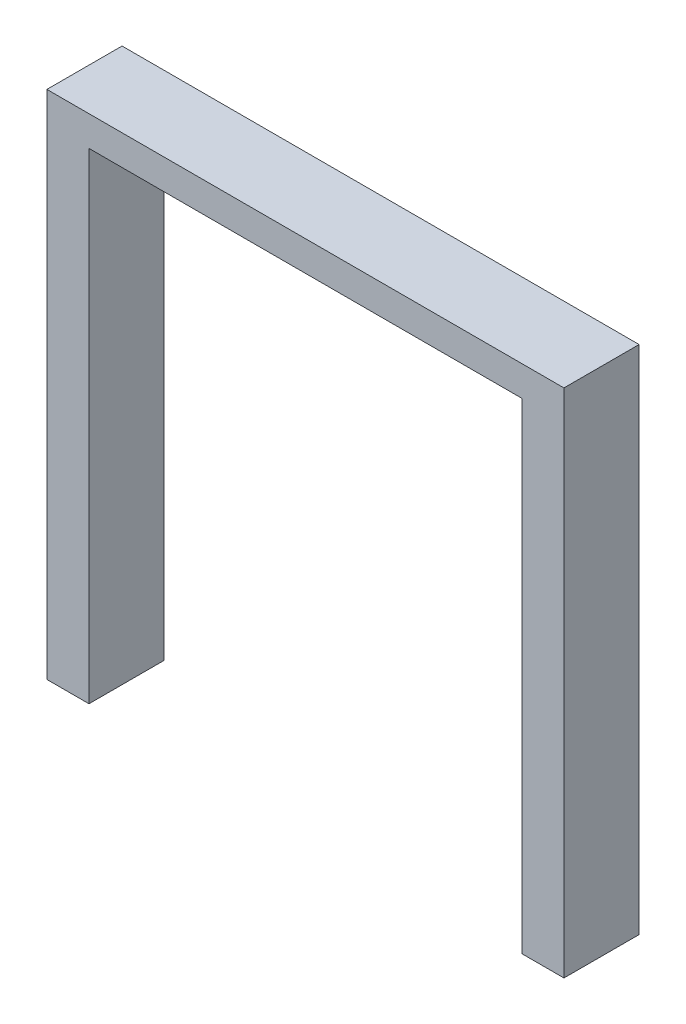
ISO-10303-21;
HEADER;
FILE_DESCRIPTION(('STEP AP214'),'2;1');
FILE_NAME('part.step','',(''),(''),'','','');
FILE_SCHEMA(('AUTOMOTIVE_DESIGN { 1 0 10303 214 1 1 1 1 }'));
ENDSEC;
DATA;
#1=APPLICATION_CONTEXT('core data for automotive mechanical design processes');
#2=APPLICATION_PROTOCOL_DEFINITION('international standard','automotive_design',2000,#1);
#3=PRODUCT_CONTEXT('',#1,'mechanical');
#4=PRODUCT('Part','Part','',(#3));
#5=PRODUCT_RELATED_PRODUCT_CATEGORY('part','',(#4));
#6=PRODUCT_DEFINITION_FORMATION('','',#4);
#7=PRODUCT_DEFINITION_CONTEXT('part definition',#1,'design');
#8=PRODUCT_DEFINITION('design','',#6,#7);
#9=PRODUCT_DEFINITION_SHAPE('','',#8);
#10=(LENGTH_UNIT() NAMED_UNIT(*) SI_UNIT(.MILLI.,.METRE.));
#11=(NAMED_UNIT(*) PLANE_ANGLE_UNIT() SI_UNIT($,.RADIAN.));
#12=(NAMED_UNIT(*) SI_UNIT($,.STERADIAN.) SOLID_ANGLE_UNIT());
#13=UNCERTAINTY_MEASURE_WITH_UNIT(LENGTH_MEASURE(1.E-05),#10,'distance_accuracy_value','');
#14=(GEOMETRIC_REPRESENTATION_CONTEXT(3) GLOBAL_UNCERTAINTY_ASSIGNED_CONTEXT((#13)) GLOBAL_UNIT_ASSIGNED_CONTEXT((#10,
#11,#12)) REPRESENTATION_CONTEXT('',''));
#15=CARTESIAN_POINT('',(0.,0.,0.));
#16=DIRECTION('',(0.,0.,1.));
#17=DIRECTION('',(1.,0.,0.));
#18=AXIS2_PLACEMENT_3D('',#15,#16,#17);
#19=CARTESIAN_POINT('',(43.,0.,6.25));
#20=DIRECTION('',(-1.,0.,0.));
#21=DIRECTION('',(0.,0.,1.));
#22=AXIS2_PLACEMENT_3D('',#19,#20,#21);
#23=PLANE('',#22);
#24=DIRECTION('',(0.,1.,0.));
#25=VECTOR('',#24,1.);
#26=CARTESIAN_POINT('',(43.,0.,-6.25));
#27=LINE('',#26,#25);
#28=CARTESIAN_POINT('',(43.,0.,-6.25));
#29=VERTEX_POINT('',#28);
#30=CARTESIAN_POINT('',(43.,85.,-6.25));
#31=VERTEX_POINT('',#30);
#32=EDGE_CURVE('E132',#29,#31,#27,.T.);
#33=ORIENTED_EDGE('',*,*,#32,.T.);
#34=DIRECTION('',(0.,0.,-1.));
#35=VECTOR('',#34,1.);
#36=CARTESIAN_POINT('',(43.,85.,6.25));
#37=LINE('',#36,#35);
#38=CARTESIAN_POINT('',(43.,85.,6.25));
#39=VERTEX_POINT('',#38);
#40=EDGE_CURVE('E11',#39,#31,#37,.T.);
#41=ORIENTED_EDGE('',*,*,#40,.F.);
#42=DIRECTION('',(0.,1.,0.));
#43=VECTOR('',#42,1.);
#44=CARTESIAN_POINT('',(43.,0.,6.25));
#45=LINE('',#44,#43);
#46=CARTESIAN_POINT('',(43.,0.,6.25));
#47=VERTEX_POINT('',#46);
#48=EDGE_CURVE('E146',#47,#39,#45,.T.);
#49=ORIENTED_EDGE('',*,*,#48,.F.);
#50=DIRECTION('',(0.,0.,-1.));
#51=VECTOR('',#50,1.);
#52=CARTESIAN_POINT('',(43.,0.,6.25));
#53=LINE('',#52,#51);
#54=EDGE_CURVE('E128',#47,#29,#53,.T.);
#55=ORIENTED_EDGE('',*,*,#54,.T.);
#56=EDGE_LOOP('',(#33,#41,#49,#55));
#57=FACE_BOUND('',#56,.T.);
#58=ADVANCED_FACE('F36',(#57),#23,.F.);
#59=CARTESIAN_POINT('',(-43.,85.,6.25));
#60=DIRECTION('',(0.,-1.,0.));
#61=DIRECTION('',(0.,0.,-1.));
#62=AXIS2_PLACEMENT_3D('',#59,#60,#61);
#63=PLANE('',#62);
#64=DIRECTION('',(-1.,0.,0.));
#65=VECTOR('',#64,1.);
#66=CARTESIAN_POINT('',(-43.,85.,-6.25));
#67=LINE('',#66,#65);
#68=CARTESIAN_POINT('',(-43.,85.,-6.25));
#69=VERTEX_POINT('',#68);
#70=EDGE_CURVE('E135',#31,#69,#67,.T.);
#71=ORIENTED_EDGE('',*,*,#70,.T.);
#72=DIRECTION('',(0.,0.,-1.));
#73=VECTOR('',#72,1.);
#74=CARTESIAN_POINT('',(-43.,85.,6.25));
#75=LINE('',#74,#73);
#76=CARTESIAN_POINT('',(-43.,85.,6.25));
#77=VERTEX_POINT('',#76);
#78=EDGE_CURVE('E44',#77,#69,#75,.T.);
#79=ORIENTED_EDGE('',*,*,#78,.F.);
#80=DIRECTION('',(-1.,0.,0.));
#81=VECTOR('',#80,1.);
#82=CARTESIAN_POINT('',(-43.,85.,6.25));
#83=LINE('',#82,#81);
#84=EDGE_CURVE('E95',#39,#77,#83,.T.);
#85=ORIENTED_EDGE('',*,*,#84,.F.);
#86=ORIENTED_EDGE('',*,*,#40,.T.);
#87=EDGE_LOOP('',(#71,#79,#85,#86));
#88=FACE_BOUND('',#87,.T.);
#89=ADVANCED_FACE('F181',(#88),#63,.F.);
#90=CARTESIAN_POINT('',(-43.,0.,6.25));
#91=DIRECTION('',(1.,0.,0.));
#92=DIRECTION('',(0.,0.,-1.));
#93=AXIS2_PLACEMENT_3D('',#90,#91,#92);
#94=PLANE('',#93);
#95=DIRECTION('',(0.,-1.,0.));
#96=VECTOR('',#95,1.);
#97=CARTESIAN_POINT('',(-43.,0.,-6.25));
#98=LINE('',#97,#96);
#99=CARTESIAN_POINT('',(-43.,0.,-6.25));
#100=VERTEX_POINT('',#99);
#101=EDGE_CURVE('E137',#69,#100,#98,.T.);
#102=ORIENTED_EDGE('',*,*,#101,.T.);
#103=DIRECTION('',(0.,0.,-1.));
#104=VECTOR('',#103,1.);
#105=CARTESIAN_POINT('',(-43.,0.,6.25));
#106=LINE('',#105,#104);
#107=CARTESIAN_POINT('',(-43.,0.,6.25));
#108=VERTEX_POINT('',#107);
#109=EDGE_CURVE('E153',#108,#100,#106,.T.);
#110=ORIENTED_EDGE('',*,*,#109,.F.);
#111=DIRECTION('',(0.,-1.,0.));
#112=VECTOR('',#111,1.);
#113=CARTESIAN_POINT('',(-43.,0.,6.25));
#114=LINE('',#113,#112);
#115=EDGE_CURVE('E161',#77,#108,#114,.T.);
#116=ORIENTED_EDGE('',*,*,#115,.F.);
#117=ORIENTED_EDGE('',*,*,#78,.T.);
#118=EDGE_LOOP('',(#102,#110,#116,#117));
#119=FACE_BOUND('',#118,.T.);
#120=ADVANCED_FACE('F159',(#119),#94,.F.);
#121=CARTESIAN_POINT('',(-36.,0.,6.25));
#122=DIRECTION('',(0.,1.,0.));
#123=DIRECTION('',(-1.,0.,0.));
#124=AXIS2_PLACEMENT_3D('',#121,#122,#123);
#125=PLANE('',#124);
#126=DIRECTION('',(1.,0.,0.));
#127=VECTOR('',#126,1.);
#128=CARTESIAN_POINT('',(-36.,0.,-6.25));
#129=LINE('',#128,#127);
#130=CARTESIAN_POINT('',(-36.,0.,-6.25));
#131=VERTEX_POINT('',#130);
#132=EDGE_CURVE('E139',#100,#131,#129,.T.);
#133=ORIENTED_EDGE('',*,*,#132,.T.);
#134=DIRECTION('',(0.,0.,-1.));
#135=VECTOR('',#134,1.);
#136=CARTESIAN_POINT('',(-36.,0.,6.25));
#137=LINE('',#136,#135);
#138=CARTESIAN_POINT('',(-36.,0.,6.25));
#139=VERTEX_POINT('',#138);
#140=EDGE_CURVE('E150',#139,#131,#137,.T.);
#141=ORIENTED_EDGE('',*,*,#140,.F.);
#142=DIRECTION('',(1.,0.,0.));
#143=VECTOR('',#142,1.);
#144=CARTESIAN_POINT('',(-36.,0.,6.25));
#145=LINE('',#144,#143);
#146=EDGE_CURVE('E173',#108,#139,#145,.T.);
#147=ORIENTED_EDGE('',*,*,#146,.F.);
#148=ORIENTED_EDGE('',*,*,#109,.T.);
#149=EDGE_LOOP('',(#133,#141,#147,#148));
#150=FACE_BOUND('',#149,.T.);
#151=ADVANCED_FACE('F169',(#150),#125,.F.);
#152=CARTESIAN_POINT('',(-36.,0.,6.25));
#153=DIRECTION('',(-1.,0.,0.));
#154=DIRECTION('',(0.,0.,1.));
#155=AXIS2_PLACEMENT_3D('',#152,#153,#154);
#156=PLANE('',#155);
#157=DIRECTION('',(0.,1.,0.));
#158=VECTOR('',#157,1.);
#159=CARTESIAN_POINT('',(-36.,0.,-6.25));
#160=LINE('',#159,#158);
#161=CARTESIAN_POINT('',(-36.,80.,-6.25));
#162=VERTEX_POINT('',#161);
#163=EDGE_CURVE('E141',#131,#162,#160,.T.);
#164=ORIENTED_EDGE('',*,*,#163,.T.);
#165=DIRECTION('',(0.,0.,-1.));
#166=VECTOR('',#165,1.);
#167=CARTESIAN_POINT('',(-36.,80.,6.25));
#168=LINE('',#167,#166);
#169=CARTESIAN_POINT('',(-36.,80.,6.25));
#170=VERTEX_POINT('',#169);
#171=EDGE_CURVE('E123',#170,#162,#168,.T.);
#172=ORIENTED_EDGE('',*,*,#171,.F.);
#173=DIRECTION('',(0.,1.,0.));
#174=VECTOR('',#173,1.);
#175=CARTESIAN_POINT('',(-36.,0.,6.25));
#176=LINE('',#175,#174);
#177=EDGE_CURVE('E114',#139,#170,#176,.T.);
#178=ORIENTED_EDGE('',*,*,#177,.F.);
#179=ORIENTED_EDGE('',*,*,#140,.T.);
#180=EDGE_LOOP('',(#164,#172,#178,#179));
#181=FACE_BOUND('',#180,.T.);
#182=ADVANCED_FACE('F172',(#181),#156,.F.);
#183=CARTESIAN_POINT('',(-36.,80.,6.25));
#184=DIRECTION('',(0.,1.,0.));
#185=DIRECTION('',(0.,0.,1.));
#186=AXIS2_PLACEMENT_3D('',#183,#184,#185);
#187=PLANE('',#186);
#188=DIRECTION('',(1.,0.,0.));
#189=VECTOR('',#188,1.);
#190=CARTESIAN_POINT('',(-36.,80.,-6.25));
#191=LINE('',#190,#189);
#192=CARTESIAN_POINT('',(36.,80.,-6.25));
#193=VERTEX_POINT('',#192);
#194=EDGE_CURVE('E122',#162,#193,#191,.T.);
#195=ORIENTED_EDGE('',*,*,#194,.T.);
#196=DIRECTION('',(0.,0.,-1.));
#197=VECTOR('',#196,1.);
#198=CARTESIAN_POINT('',(36.,80.,6.25));
#199=LINE('',#198,#197);
#200=CARTESIAN_POINT('',(36.,80.,6.25));
#201=VERTEX_POINT('',#200);
#202=EDGE_CURVE('E119',#201,#193,#199,.T.);
#203=ORIENTED_EDGE('',*,*,#202,.F.);
#204=DIRECTION('',(1.,0.,0.));
#205=VECTOR('',#204,1.);
#206=CARTESIAN_POINT('',(-36.,80.,6.25));
#207=LINE('',#206,#205);
#208=EDGE_CURVE('E108',#170,#201,#207,.T.);
#209=ORIENTED_EDGE('',*,*,#208,.F.);
#210=ORIENTED_EDGE('',*,*,#171,.T.);
#211=EDGE_LOOP('',(#195,#203,#209,#210));
#212=FACE_BOUND('',#211,.T.);
#213=ADVANCED_FACE('F120',(#212),#187,.F.);
#214=CARTESIAN_POINT('',(36.,0.,6.25));
#215=DIRECTION('',(1.,0.,0.));
#216=DIRECTION('',(0.,0.,-1.));
#217=AXIS2_PLACEMENT_3D('',#214,#215,#216);
#218=PLANE('',#217);
#219=DIRECTION('',(0.,-1.,0.));
#220=VECTOR('',#219,1.);
#221=CARTESIAN_POINT('',(36.,0.,-6.25));
#222=LINE('',#221,#220);
#223=CARTESIAN_POINT('',(36.,0.,-6.25));
#224=VERTEX_POINT('',#223);
#225=EDGE_CURVE('E81',#193,#224,#222,.T.);
#226=ORIENTED_EDGE('',*,*,#225,.T.);
#227=DIRECTION('',(0.,0.,-1.));
#228=VECTOR('',#227,1.);
#229=CARTESIAN_POINT('',(36.,0.,6.25));
#230=LINE('',#229,#228);
#231=CARTESIAN_POINT('',(36.,0.,6.25));
#232=VERTEX_POINT('',#231);
#233=EDGE_CURVE('E124',#232,#224,#230,.T.);
#234=ORIENTED_EDGE('',*,*,#233,.F.);
#235=DIRECTION('',(0.,-1.,0.));
#236=VECTOR('',#235,1.);
#237=CARTESIAN_POINT('',(36.,0.,6.25));
#238=LINE('',#237,#236);
#239=EDGE_CURVE('E112',#201,#232,#238,.T.);
#240=ORIENTED_EDGE('',*,*,#239,.F.);
#241=ORIENTED_EDGE('',*,*,#202,.T.);
#242=EDGE_LOOP('',(#226,#234,#240,#241));
#243=FACE_BOUND('',#242,.T.);
#244=ADVANCED_FACE('F126',(#243),#218,.F.);
#245=CARTESIAN_POINT('',(36.,0.,6.25));
#246=DIRECTION('',(0.,1.,0.));
#247=DIRECTION('',(-1.,0.,0.));
#248=AXIS2_PLACEMENT_3D('',#245,#246,#247);
#249=PLANE('',#248);
#250=DIRECTION('',(1.,0.,0.));
#251=VECTOR('',#250,1.);
#252=CARTESIAN_POINT('',(36.,0.,-6.25));
#253=LINE('',#252,#251);
#254=EDGE_CURVE('E87',#224,#29,#253,.T.);
#255=ORIENTED_EDGE('',*,*,#254,.T.);
#256=ORIENTED_EDGE('',*,*,#54,.F.);
#257=DIRECTION('',(1.,0.,0.));
#258=VECTOR('',#257,1.);
#259=CARTESIAN_POINT('',(36.,0.,6.25));
#260=LINE('',#259,#258);
#261=EDGE_CURVE('E52',#232,#47,#260,.T.);
#262=ORIENTED_EDGE('',*,*,#261,.F.);
#263=ORIENTED_EDGE('',*,*,#233,.T.);
#264=EDGE_LOOP('',(#255,#256,#262,#263));
#265=FACE_BOUND('',#264,.T.);
#266=ADVANCED_FACE('F197',(#265),#249,.F.);
#267=CARTESIAN_POINT('',(0.,0.,6.25));
#268=DIRECTION('',(0.,0.,-1.));
#269=DIRECTION('',(-1.,0.,0.));
#270=AXIS2_PLACEMENT_3D('',#267,#268,#269);
#271=PLANE('',#270);
#272=ORIENTED_EDGE('',*,*,#48,.T.);
#273=ORIENTED_EDGE('',*,*,#84,.T.);
#274=ORIENTED_EDGE('',*,*,#115,.T.);
#275=ORIENTED_EDGE('',*,*,#146,.T.);
#276=ORIENTED_EDGE('',*,*,#177,.T.);
#277=ORIENTED_EDGE('',*,*,#208,.T.);
#278=ORIENTED_EDGE('',*,*,#239,.T.);
#279=ORIENTED_EDGE('',*,*,#261,.T.);
#280=EDGE_LOOP('',(#272,#273,#274,#275,#276,#277,#278,#279));
#281=FACE_BOUND('',#280,.T.);
#282=ADVANCED_FACE('F110',(#281),#271,.F.);
#283=CARTESIAN_POINT('',(0.,0.,-6.25));
#284=DIRECTION('',(0.,0.,-1.));
#285=DIRECTION('',(-1.,0.,0.));
#286=AXIS2_PLACEMENT_3D('',#283,#284,#285);
#287=PLANE('',#286);
#288=ORIENTED_EDGE('',*,*,#32,.F.);
#289=ORIENTED_EDGE('',*,*,#254,.F.);
#290=ORIENTED_EDGE('',*,*,#225,.F.);
#291=ORIENTED_EDGE('',*,*,#194,.F.);
#292=ORIENTED_EDGE('',*,*,#163,.F.);
#293=ORIENTED_EDGE('',*,*,#132,.F.);
#294=ORIENTED_EDGE('',*,*,#101,.F.);
#295=ORIENTED_EDGE('',*,*,#70,.F.);
#296=EDGE_LOOP('',(#288,#289,#290,#291,#292,#293,#294,#295));
#297=FACE_BOUND('',#296,.T.);
#298=ADVANCED_FACE('F165',(#297),#287,.T.);
#299=CLOSED_SHELL('',(#58,#89,#120,#151,#182,#213,#244,#266,#282,#298));
#300=MANIFOLD_SOLID_BREP('B2',#299);
#301=ADVANCED_BREP_SHAPE_REPRESENTATION('',(#18,#300),#14);
#302=SHAPE_DEFINITION_REPRESENTATION(#9,#301);
ENDSEC;
END-ISO-10303-21;
